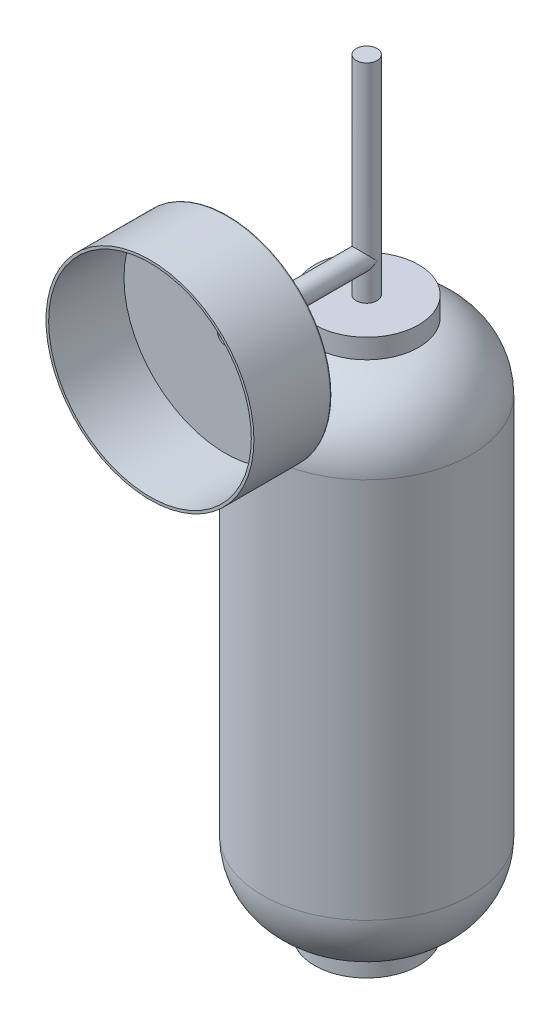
ISO-10303-21;
HEADER;
FILE_DESCRIPTION(('STEP AP214'),'2;1');
FILE_NAME('part.step','',(''),(''),'','','');
FILE_SCHEMA(('AUTOMOTIVE_DESIGN { 1 0 10303 214 1 1 1 1 }'));
ENDSEC;
DATA;
#1=APPLICATION_CONTEXT('core data for automotive mechanical design processes');
#2=APPLICATION_PROTOCOL_DEFINITION('international standard','automotive_design',2000,#1);
#3=PRODUCT_CONTEXT('',#1,'mechanical');
#4=PRODUCT('Part','Part','',(#3));
#5=PRODUCT_RELATED_PRODUCT_CATEGORY('part','',(#4));
#6=PRODUCT_DEFINITION_FORMATION('','',#4);
#7=PRODUCT_DEFINITION_CONTEXT('part definition',#1,'design');
#8=PRODUCT_DEFINITION('design','',#6,#7);
#9=PRODUCT_DEFINITION_SHAPE('','',#8);
#10=(LENGTH_UNIT() NAMED_UNIT(*) SI_UNIT(.MILLI.,.METRE.));
#11=(NAMED_UNIT(*) PLANE_ANGLE_UNIT() SI_UNIT($,.RADIAN.));
#12=(NAMED_UNIT(*) SI_UNIT($,.STERADIAN.) SOLID_ANGLE_UNIT());
#13=UNCERTAINTY_MEASURE_WITH_UNIT(LENGTH_MEASURE(1.E-05),#10,'distance_accuracy_value','');
#14=(GEOMETRIC_REPRESENTATION_CONTEXT(3) GLOBAL_UNCERTAINTY_ASSIGNED_CONTEXT((#13)) GLOBAL_UNIT_ASSIGNED_CONTEXT((#10,
#11,#12)) REPRESENTATION_CONTEXT('',''));
#15=CARTESIAN_POINT('',(0.,0.,0.));
#16=DIRECTION('',(0.,0.,1.));
#17=DIRECTION('',(1.,0.,0.));
#18=AXIS2_PLACEMENT_3D('',#15,#16,#17);
#19=CARTESIAN_POINT('',(0.,5.,0.));
#20=DIRECTION('',(0.,1.,0.));
#21=DIRECTION('',(0.,0.,1.));
#22=AXIS2_PLACEMENT_3D('',#19,#20,#21);
#23=CYLINDRICAL_SURFACE('',#22,30.);
#24=CARTESIAN_POINT('',(0.,5.,0.));
#25=DIRECTION('',(0.,1.,0.));
#26=DIRECTION('',(0.,0.,1.));
#27=AXIS2_PLACEMENT_3D('',#24,#25,#26);
#28=CIRCLE('',#27,30.);
#29=CARTESIAN_POINT('',(0.,5.,30.));
#30=VERTEX_POINT('',#29);
#31=EDGE_CURVE('E12',#30,#30,#28,.T.);
#32=ORIENTED_EDGE('',*,*,#31,.T.);
#33=EDGE_LOOP('',(#32));
#34=FACE_BOUND('',#33,.T.);
#35=CARTESIAN_POINT('',(0.,295.,0.));
#36=DIRECTION('',(0.,1.,0.));
#37=DIRECTION('',(0.,0.,1.));
#38=AXIS2_PLACEMENT_3D('',#35,#36,#37);
#39=CIRCLE('',#38,30.);
#40=CARTESIAN_POINT('',(0.,295.,30.));
#41=VERTEX_POINT('',#40);
#42=EDGE_CURVE('E61',#41,#41,#39,.T.);
#43=ORIENTED_EDGE('',*,*,#42,.F.);
#44=EDGE_LOOP('',(#43));
#45=FACE_BOUND('',#44,.T.);
#46=ADVANCED_FACE('F55',(#34,#45),#23,.T.);
#47=CARTESIAN_POINT('',(0.,5.,0.));
#48=DIRECTION('',(0.,1.,0.));
#49=DIRECTION('',(0.,0.,1.));
#50=AXIS2_PLACEMENT_3D('',#47,#48,#49);
#51=PLANE('',#50);
#52=ORIENTED_EDGE('',*,*,#31,.F.);
#53=EDGE_LOOP('',(#52));
#54=FACE_BOUND('',#53,.T.);
#55=ADVANCED_FACE('F70',(#54),#51,.F.);
#56=CARTESIAN_POINT('',(0.,295.,0.));
#57=DIRECTION('',(0.,1.,0.));
#58=DIRECTION('',(0.,0.,1.));
#59=AXIS2_PLACEMENT_3D('',#56,#57,#58);
#60=PLANE('',#59);
#61=ORIENTED_EDGE('',*,*,#42,.T.);
#62=EDGE_LOOP('',(#61));
#63=FACE_BOUND('',#62,.T.);
#64=ADVANCED_FACE('F67',(#63),#60,.T.);
#65=CLOSED_SHELL('',(#46,#55,#64));
#66=MANIFOLD_SOLID_BREP('B2',#65);
#67=CARTESIAN_POINT('',(0.,-10.,0.));
#68=DIRECTION('',(0.,1.,0.));
#69=DIRECTION('',(0.,0.,-1.));
#70=AXIS2_PLACEMENT_3D('',#67,#68,#69);
#71=CYLINDRICAL_SURFACE('',#70,30.);
#72=CARTESIAN_POINT('',(0.,-10.,0.));
#73=DIRECTION('',(0.,1.,0.));
#74=DIRECTION('',(0.,0.,1.));
#75=AXIS2_PLACEMENT_3D('',#72,#73,#74);
#76=CIRCLE('',#75,30.);
#77=CARTESIAN_POINT('',(0.,-10.,30.));
#78=VERTEX_POINT('',#77);
#79=EDGE_CURVE('E111',#78,#78,#76,.T.);
#80=ORIENTED_EDGE('',*,*,#79,.T.);
#81=EDGE_LOOP('',(#80));
#82=FACE_BOUND('',#81,.T.);
#83=CARTESIAN_POINT('',(0.,1.27016653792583,0.));
#84=DIRECTION('',(0.,-1.,0.));
#85=DIRECTION('',(0.,0.,-1.));
#86=AXIS2_PLACEMENT_3D('',#83,#84,#85);
#87=CIRCLE('',#86,30.);
#88=CARTESIAN_POINT('',(0.,1.27016653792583,-30.));
#89=VERTEX_POINT('',#88);
#90=EDGE_CURVE('E115',#89,#89,#87,.F.);
#91=ORIENTED_EDGE('',*,*,#90,.F.);
#92=EDGE_LOOP('',(#91));
#93=FACE_BOUND('',#92,.T.);
#94=ADVANCED_FACE('F105',(#82,#93),#71,.T.);
#95=CARTESIAN_POINT('',(0.,-10.,0.));
#96=DIRECTION('',(0.,-1.,0.));
#97=DIRECTION('',(0.,0.,1.));
#98=AXIS2_PLACEMENT_3D('',#95,#96,#97);
#99=PLANE('',#98);
#100=ORIENTED_EDGE('',*,*,#79,.F.);
#101=EDGE_LOOP('',(#100));
#102=FACE_BOUND('',#101,.T.);
#103=ADVANCED_FACE('F126',(#102),#99,.T.);
#104=CARTESIAN_POINT('',(0.,40.,0.));
#105=DIRECTION('',(0.,1.,0.));
#106=DIRECTION('',(0.,0.,-1.));
#107=AXIS2_PLACEMENT_3D('',#104,#105,#106);
#108=DEGENERATE_TOROIDAL_SURFACE('',#107,20.,40.,.T.);
#109=ORIENTED_EDGE('',*,*,#90,.T.);
#110=EDGE_LOOP('',(#109));
#111=FACE_BOUND('',#110,.T.);
#112=CARTESIAN_POINT('',(0.,0.,0.));
#113=DIRECTION('',(0.,-1.,0.));
#114=DIRECTION('',(0.,0.,-1.));
#115=AXIS2_PLACEMENT_3D('',#112,#113,#114);
#116=CIRCLE('',#115,20.);
#117=CARTESIAN_POINT('',(0.,0.,-20.));
#118=VERTEX_POINT('',#117);
#119=EDGE_CURVE('E54',#118,#118,#116,.F.);
#120=ORIENTED_EDGE('',*,*,#119,.F.);
#121=EDGE_LOOP('',(#120));
#122=FACE_BOUND('',#121,.T.);
#123=ADVANCED_FACE('F122',(#111,#122),#108,.F.);
#124=CARTESIAN_POINT('',(0.,0.,0.));
#125=DIRECTION('',(0.,-1.,0.));
#126=DIRECTION('',(0.,0.,1.));
#127=AXIS2_PLACEMENT_3D('',#124,#125,#126);
#128=PLANE('',#127);
#129=ORIENTED_EDGE('',*,*,#119,.T.);
#130=EDGE_LOOP('',(#129));
#131=FACE_BOUND('',#130,.T.);
#132=ADVANCED_FACE('F135',(#131),#128,.F.);
#133=CLOSED_SHELL('',(#94,#103,#123,#132));
#134=MANIFOLD_SOLID_BREP('B7',#133);
#135=CARTESIAN_POINT('',(0.,310.,0.));
#136=DIRECTION('',(0.,-1.,0.));
#137=DIRECTION('',(0.,0.,-1.));
#138=AXIS2_PLACEMENT_3D('',#135,#136,#137);
#139=CYLINDRICAL_SURFACE('',#138,30.);
#140=CARTESIAN_POINT('',(0.,310.,0.));
#141=DIRECTION('',(0.,1.,0.));
#142=DIRECTION('',(0.,0.,1.));
#143=AXIS2_PLACEMENT_3D('',#140,#141,#142);
#144=CIRCLE('',#143,30.);
#145=CARTESIAN_POINT('',(0.,310.,30.));
#146=VERTEX_POINT('',#145);
#147=EDGE_CURVE('E237',#146,#146,#144,.T.);
#148=ORIENTED_EDGE('',*,*,#147,.F.);
#149=EDGE_LOOP('',(#148));
#150=FACE_BOUND('',#149,.T.);
#151=CARTESIAN_POINT('',(0.,298.729833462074,0.));
#152=DIRECTION('',(0.,-1.,0.));
#153=DIRECTION('',(0.,0.,-1.));
#154=AXIS2_PLACEMENT_3D('',#151,#152,#153);
#155=CIRCLE('',#154,30.);
#156=CARTESIAN_POINT('',(0.,298.729833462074,-30.));
#157=VERTEX_POINT('',#156);
#158=EDGE_CURVE('E230',#157,#157,#155,.F.);
#159=ORIENTED_EDGE('',*,*,#158,.T.);
#160=EDGE_LOOP('',(#159));
#161=FACE_BOUND('',#160,.T.);
#162=ADVANCED_FACE('F167',(#150,#161),#139,.T.);
#163=CARTESIAN_POINT('',(0.,310.,0.));
#164=DIRECTION('',(0.,1.,0.));
#165=DIRECTION('',(0.,0.,1.));
#166=AXIS2_PLACEMENT_3D('',#163,#164,#165);
#167=PLANE('',#166);
#168=CARTESIAN_POINT('',(0.,310.,0.));
#169=DIRECTION('',(0.,1.,0.));
#170=DIRECTION('',(0.,0.,1.));
#171=AXIS2_PLACEMENT_3D('',#168,#169,#170);
#172=CIRCLE('',#171,6.);
#173=CARTESIAN_POINT('',(0.,310.,6.));
#174=VERTEX_POINT('',#173);
#175=EDGE_CURVE('E231',#174,#174,#172,.T.);
#176=ORIENTED_EDGE('',*,*,#175,.F.);
#177=EDGE_LOOP('',(#176));
#178=FACE_BOUND('',#177,.T.);
#179=ORIENTED_EDGE('',*,*,#147,.T.);
#180=EDGE_LOOP('',(#179));
#181=FACE_BOUND('',#180,.T.);
#182=ADVANCED_FACE('F265',(#178,#181),#167,.T.);
#183=CARTESIAN_POINT('',(0.,260.,0.));
#184=DIRECTION('',(0.,-1.,0.));
#185=DIRECTION('',(0.,0.,-1.));
#186=AXIS2_PLACEMENT_3D('',#183,#184,#185);
#187=DEGENERATE_TOROIDAL_SURFACE('',#186,20.,40.,.T.);
#188=ORIENTED_EDGE('',*,*,#158,.F.);
#189=EDGE_LOOP('',(#188));
#190=FACE_BOUND('',#189,.T.);
#191=CARTESIAN_POINT('',(0.,300.,0.));
#192=DIRECTION('',(0.,-1.,0.));
#193=DIRECTION('',(0.,0.,-1.));
#194=AXIS2_PLACEMENT_3D('',#191,#192,#193);
#195=CIRCLE('',#194,20.);
#196=CARTESIAN_POINT('',(0.,300.,-20.));
#197=VERTEX_POINT('',#196);
#198=EDGE_CURVE('E234',#197,#197,#195,.F.);
#199=ORIENTED_EDGE('',*,*,#198,.T.);
#200=EDGE_LOOP('',(#199));
#201=FACE_BOUND('',#200,.T.);
#202=ADVANCED_FACE('F270',(#190,#201),#187,.F.);
#203=CARTESIAN_POINT('',(0.,300.,0.));
#204=DIRECTION('',(0.,1.,0.));
#205=DIRECTION('',(0.,0.,1.));
#206=AXIS2_PLACEMENT_3D('',#203,#204,#205);
#207=PLANE('',#206);
#208=ORIENTED_EDGE('',*,*,#198,.F.);
#209=EDGE_LOOP('',(#208));
#210=FACE_BOUND('',#209,.T.);
#211=ADVANCED_FACE('F276',(#210),#207,.F.);
#212=CARTESIAN_POINT('',(0.,430.,0.));
#213=DIRECTION('',(0.,-1.,0.));
#214=DIRECTION('',(0.,0.,-1.));
#215=AXIS2_PLACEMENT_3D('',#212,#213,#214);
#216=CYLINDRICAL_SURFACE('',#215,6.);
#217=CARTESIAN_POINT('',(0.,330.,0.));
#218=DIRECTION('',(0.,-0.707106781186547,-0.707106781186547));
#219=DIRECTION('',(0.,-0.707106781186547,0.707106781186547));
#220=AXIS2_PLACEMENT_3D('',#217,#218,#219);
#221=ELLIPSE('',#220,8.48528137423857,6.);
#222=CARTESIAN_POINT('',(6.,330.,0.));
#223=VERTEX_POINT('',#222);
#224=CARTESIAN_POINT('',(-6.,330.,0.));
#225=VERTEX_POINT('',#224);
#226=EDGE_CURVE('E184',#223,#225,#221,.T.);
#227=ORIENTED_EDGE('',*,*,#226,.T.);
#228=CARTESIAN_POINT('',(0.,330.,0.));
#229=DIRECTION('',(0.,-0.707106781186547,0.707106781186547));
#230=DIRECTION('',(0.,-0.707106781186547,-0.707106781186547));
#231=AXIS2_PLACEMENT_3D('',#228,#229,#230);
#232=ELLIPSE('',#231,8.48528137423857,6.);
#233=EDGE_CURVE('E181',#225,#223,#232,.F.);
#234=ORIENTED_EDGE('',*,*,#233,.T.);
#235=EDGE_LOOP('',(#227,#234));
#236=FACE_BOUND('',#235,.T.);
#237=CARTESIAN_POINT('',(0.,430.,0.));
#238=DIRECTION('',(0.,1.,0.));
#239=DIRECTION('',(0.,0.,1.));
#240=AXIS2_PLACEMENT_3D('',#237,#238,#239);
#241=CIRCLE('',#240,6.);
#242=CARTESIAN_POINT('',(0.,430.,6.));
#243=VERTEX_POINT('',#242);
#244=EDGE_CURVE('E227',#243,#243,#241,.T.);
#245=ORIENTED_EDGE('',*,*,#244,.F.);
#246=EDGE_LOOP('',(#245));
#247=FACE_BOUND('',#246,.T.);
#248=ORIENTED_EDGE('',*,*,#175,.T.);
#249=EDGE_LOOP('',(#248));
#250=FACE_BOUND('',#249,.T.);
#251=ADVANCED_FACE('F278',(#236,#247,#250),#216,.T.);
#252=CARTESIAN_POINT('',(0.,430.,0.));
#253=DIRECTION('',(0.,1.,0.));
#254=DIRECTION('',(0.,0.,1.));
#255=AXIS2_PLACEMENT_3D('',#252,#253,#254);
#256=PLANE('',#255);
#257=ORIENTED_EDGE('',*,*,#244,.T.);
#258=EDGE_LOOP('',(#257));
#259=FACE_BOUND('',#258,.T.);
#260=ADVANCED_FACE('F286',(#259),#256,.T.);
#261=CARTESIAN_POINT('',(0.,330.,0.));
#262=DIRECTION('',(0.,0.,1.));
#263=DIRECTION('',(1.,0.,0.));
#264=AXIS2_PLACEMENT_3D('',#261,#262,#263);
#265=CYLINDRICAL_SURFACE('',#264,6.);
#266=CARTESIAN_POINT('',(0.,330.,80.));
#267=DIRECTION('',(0.,0.,1.));
#268=DIRECTION('',(1.,0.,0.));
#269=AXIS2_PLACEMENT_3D('',#266,#267,#268);
#270=CIRCLE('',#269,6.);
#271=CARTESIAN_POINT('',(6.,330.,80.));
#272=VERTEX_POINT('',#271);
#273=EDGE_CURVE('E224',#272,#272,#270,.T.);
#274=ORIENTED_EDGE('',*,*,#273,.F.);
#275=EDGE_LOOP('',(#274));
#276=FACE_BOUND('',#275,.T.);
#277=ORIENTED_EDGE('',*,*,#233,.F.);
#278=ORIENTED_EDGE('',*,*,#226,.F.);
#279=EDGE_LOOP('',(#277,#278));
#280=FACE_BOUND('',#279,.T.);
#281=ADVANCED_FACE('F290',(#276,#280),#265,.T.);
#282=CARTESIAN_POINT('',(0.,330.,124.958));
#283=DIRECTION('',(0.,0.,-1.));
#284=DIRECTION('',(-1.,0.,0.));
#285=AXIS2_PLACEMENT_3D('',#282,#283,#284);
#286=CYLINDRICAL_SURFACE('',#285,59.944);
#287=CARTESIAN_POINT('',(0.,330.,81.));
#288=DIRECTION('',(0.,0.,1.));
#289=DIRECTION('',(1.,0.,0.));
#290=AXIS2_PLACEMENT_3D('',#287,#288,#289);
#291=CIRCLE('',#290,59.944);
#292=CARTESIAN_POINT('',(59.944,330.,81.));
#293=VERTEX_POINT('',#292);
#294=EDGE_CURVE('E175',#293,#293,#291,.T.);
#295=ORIENTED_EDGE('',*,*,#294,.T.);
#296=EDGE_LOOP('',(#295));
#297=FACE_BOUND('',#296,.T.);
#298=CARTESIAN_POINT('',(0.,330.,124.958));
#299=DIRECTION('',(0.,0.,1.));
#300=DIRECTION('',(1.,0.,0.));
#301=AXIS2_PLACEMENT_3D('',#298,#299,#300);
#302=CIRCLE('',#301,59.944);
#303=CARTESIAN_POINT('',(59.944,330.,124.958));
#304=VERTEX_POINT('',#303);
#305=EDGE_CURVE('E204',#304,#304,#302,.T.);
#306=ORIENTED_EDGE('',*,*,#305,.F.);
#307=EDGE_LOOP('',(#306));
#308=FACE_BOUND('',#307,.T.);
#309=ADVANCED_FACE('F246',(#297,#308),#286,.T.);
#310=CARTESIAN_POINT('',(0.,330.,124.958));
#311=DIRECTION('',(0.,0.,1.));
#312=DIRECTION('',(1.,0.,0.));
#313=AXIS2_PLACEMENT_3D('',#310,#311,#312);
#314=PLANE('',#313);
#315=CARTESIAN_POINT('',(0.,330.,124.958));
#316=DIRECTION('',(0.,0.,1.));
#317=DIRECTION('',(1.,0.,0.));
#318=AXIS2_PLACEMENT_3D('',#315,#316,#317);
#319=CIRCLE('',#318,58.444);
#320=CARTESIAN_POINT('',(58.444,330.,124.958));
#321=VERTEX_POINT('',#320);
#322=EDGE_CURVE('E214',#321,#321,#319,.T.);
#323=ORIENTED_EDGE('',*,*,#322,.F.);
#324=EDGE_LOOP('',(#323));
#325=FACE_BOUND('',#324,.T.);
#326=ORIENTED_EDGE('',*,*,#305,.T.);
#327=EDGE_LOOP('',(#326));
#328=FACE_BOUND('',#327,.T.);
#329=ADVANCED_FACE('F260',(#325,#328),#314,.T.);
#330=CARTESIAN_POINT('',(0.,330.,80.));
#331=DIRECTION('',(0.,0.,1.));
#332=DIRECTION('',(1.,0.,0.));
#333=AXIS2_PLACEMENT_3D('',#330,#331,#332);
#334=PLANE('',#333);
#335=CARTESIAN_POINT('',(0.,330.,80.));
#336=DIRECTION('',(0.,0.,1.));
#337=DIRECTION('',(1.,0.,0.));
#338=AXIS2_PLACEMENT_3D('',#335,#336,#337);
#339=CIRCLE('',#338,58.944);
#340=CARTESIAN_POINT('',(58.944,330.,80.));
#341=VERTEX_POINT('',#340);
#342=EDGE_CURVE('E103',#341,#341,#339,.F.);
#343=ORIENTED_EDGE('',*,*,#342,.T.);
#344=EDGE_LOOP('',(#343));
#345=FACE_BOUND('',#344,.T.);
#346=ORIENTED_EDGE('',*,*,#273,.T.);
#347=EDGE_LOOP('',(#346));
#348=FACE_BOUND('',#347,.T.);
#349=ADVANCED_FACE('F251',(#345,#348),#334,.F.);
#350=CARTESIAN_POINT('',(0.,330.,81.));
#351=DIRECTION('',(0.,0.,1.));
#352=DIRECTION('',(1.,0.,0.));
#353=AXIS2_PLACEMENT_3D('',#350,#351,#352);
#354=TOROIDAL_SURFACE('',#353,58.944,1.);
#355=ORIENTED_EDGE('',*,*,#342,.F.);
#356=EDGE_LOOP('',(#355));
#357=FACE_BOUND('',#356,.T.);
#358=ORIENTED_EDGE('',*,*,#294,.F.);
#359=EDGE_LOOP('',(#358));
#360=FACE_BOUND('',#359,.T.);
#361=ADVANCED_FACE('F169',(#357,#360),#354,.T.);
#362=CARTESIAN_POINT('',(0.,310.,0.));
#363=DIRECTION('',(0.,-1.,0.));
#364=DIRECTION('',(0.,0.,-1.));
#365=AXIS2_PLACEMENT_3D('',#362,#363,#364);
#366=CYLINDRICAL_SURFACE('',#365,28.5);
#367=CARTESIAN_POINT('',(0.,308.5,0.));
#368=DIRECTION('',(0.,1.,0.));
#369=DIRECTION('',(0.,0.,1.));
#370=AXIS2_PLACEMENT_3D('',#367,#368,#369);
#371=CIRCLE('',#370,28.5);
#372=CARTESIAN_POINT('',(0.,308.5,28.5));
#373=VERTEX_POINT('',#372);
#374=EDGE_CURVE('E219',#373,#373,#371,.T.);
#375=ORIENTED_EDGE('',*,*,#374,.T.);
#376=EDGE_LOOP('',(#375));
#377=FACE_BOUND('',#376,.T.);
#378=CARTESIAN_POINT('',(0.,300.62019202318,0.));
#379=DIRECTION('',(0.,-1.,0.));
#380=DIRECTION('',(0.,0.,-1.));
#381=AXIS2_PLACEMENT_3D('',#378,#379,#380);
#382=CIRCLE('',#381,28.5);
#383=CARTESIAN_POINT('',(0.,300.62019202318,-28.5));
#384=VERTEX_POINT('',#383);
#385=EDGE_CURVE('E211',#384,#384,#382,.F.);
#386=ORIENTED_EDGE('',*,*,#385,.F.);
#387=EDGE_LOOP('',(#386));
#388=FACE_BOUND('',#387,.T.);
#389=ADVANCED_FACE('F250',(#377,#388),#366,.F.);
#390=CARTESIAN_POINT('',(0.,308.5,0.));
#391=DIRECTION('',(0.,1.,0.));
#392=DIRECTION('',(0.,0.,1.));
#393=AXIS2_PLACEMENT_3D('',#390,#391,#392);
#394=PLANE('',#393);
#395=CARTESIAN_POINT('',(0.,308.5,0.));
#396=DIRECTION('',(0.,1.,0.));
#397=DIRECTION('',(0.,0.,1.));
#398=AXIS2_PLACEMENT_3D('',#395,#396,#397);
#399=CIRCLE('',#398,4.5);
#400=CARTESIAN_POINT('',(0.,308.5,4.5));
#401=VERTEX_POINT('',#400);
#402=EDGE_CURVE('E198',#401,#401,#399,.T.);
#403=ORIENTED_EDGE('',*,*,#402,.T.);
#404=EDGE_LOOP('',(#403));
#405=FACE_BOUND('',#404,.T.);
#406=ORIENTED_EDGE('',*,*,#374,.F.);
#407=EDGE_LOOP('',(#406));
#408=FACE_BOUND('',#407,.T.);
#409=ADVANCED_FACE('F257',(#405,#408),#394,.F.);
#410=CARTESIAN_POINT('',(0.,260.,0.));
#411=DIRECTION('',(0.,-1.,0.));
#412=DIRECTION('',(0.,0.,-1.));
#413=AXIS2_PLACEMENT_3D('',#410,#411,#412);
#414=DEGENERATE_TOROIDAL_SURFACE('',#413,20.,41.5,.T.);
#415=ORIENTED_EDGE('',*,*,#385,.T.);
#416=EDGE_LOOP('',(#415));
#417=FACE_BOUND('',#416,.T.);
#418=CARTESIAN_POINT('',(0.,301.5,0.));
#419=DIRECTION('',(0.,-1.,0.));
#420=DIRECTION('',(0.,0.,-1.));
#421=AXIS2_PLACEMENT_3D('',#418,#419,#420);
#422=CIRCLE('',#421,20.);
#423=CARTESIAN_POINT('',(0.,301.5,-20.));
#424=VERTEX_POINT('',#423);
#425=EDGE_CURVE('E216',#424,#424,#422,.F.);
#426=ORIENTED_EDGE('',*,*,#425,.F.);
#427=EDGE_LOOP('',(#426));
#428=FACE_BOUND('',#427,.T.);
#429=ADVANCED_FACE('F320',(#417,#428),#414,.T.);
#430=CARTESIAN_POINT('',(0.,301.5,0.));
#431=DIRECTION('',(0.,1.,0.));
#432=DIRECTION('',(0.,0.,1.));
#433=AXIS2_PLACEMENT_3D('',#430,#431,#432);
#434=PLANE('',#433);
#435=ORIENTED_EDGE('',*,*,#425,.T.);
#436=EDGE_LOOP('',(#435));
#437=FACE_BOUND('',#436,.T.);
#438=ADVANCED_FACE('F317',(#437),#434,.T.);
#439=CARTESIAN_POINT('',(0.,430.,0.));
#440=DIRECTION('',(0.,-1.,0.));
#441=DIRECTION('',(0.,0.,-1.));
#442=AXIS2_PLACEMENT_3D('',#439,#440,#441);
#443=CYLINDRICAL_SURFACE('',#442,4.5);
#444=CARTESIAN_POINT('',(0.,330.,0.));
#445=DIRECTION('',(0.,-0.707106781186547,-0.707106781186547));
#446=DIRECTION('',(0.,-0.707106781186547,0.707106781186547));
#447=AXIS2_PLACEMENT_3D('',#444,#445,#446);
#448=ELLIPSE('',#447,6.36396103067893,4.5);
#449=CARTESIAN_POINT('',(4.5,330.,0.));
#450=VERTEX_POINT('',#449);
#451=CARTESIAN_POINT('',(-4.5,330.,0.));
#452=VERTEX_POINT('',#451);
#453=EDGE_CURVE('E192',#450,#452,#448,.T.);
#454=ORIENTED_EDGE('',*,*,#453,.F.);
#455=CARTESIAN_POINT('',(0.,330.,0.));
#456=DIRECTION('',(0.,-0.707106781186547,0.707106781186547));
#457=DIRECTION('',(0.,-0.707106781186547,-0.707106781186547));
#458=AXIS2_PLACEMENT_3D('',#455,#456,#457);
#459=ELLIPSE('',#458,6.36396103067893,4.5);
#460=EDGE_CURVE('E196',#452,#450,#459,.F.);
#461=ORIENTED_EDGE('',*,*,#460,.F.);
#462=EDGE_LOOP('',(#454,#461));
#463=FACE_BOUND('',#462,.T.);
#464=CARTESIAN_POINT('',(0.,428.5,0.));
#465=DIRECTION('',(0.,1.,0.));
#466=DIRECTION('',(0.,0.,1.));
#467=AXIS2_PLACEMENT_3D('',#464,#465,#466);
#468=CIRCLE('',#467,4.5);
#469=CARTESIAN_POINT('',(0.,428.5,4.5));
#470=VERTEX_POINT('',#469);
#471=EDGE_CURVE('E208',#470,#470,#468,.T.);
#472=ORIENTED_EDGE('',*,*,#471,.T.);
#473=EDGE_LOOP('',(#472));
#474=FACE_BOUND('',#473,.T.);
#475=ORIENTED_EDGE('',*,*,#402,.F.);
#476=EDGE_LOOP('',(#475));
#477=FACE_BOUND('',#476,.T.);
#478=ADVANCED_FACE('F194',(#463,#474,#477),#443,.F.);
#479=CARTESIAN_POINT('',(0.,428.5,0.));
#480=DIRECTION('',(0.,1.,0.));
#481=DIRECTION('',(0.,0.,1.));
#482=AXIS2_PLACEMENT_3D('',#479,#480,#481);
#483=PLANE('',#482);
#484=ORIENTED_EDGE('',*,*,#471,.F.);
#485=EDGE_LOOP('',(#484));
#486=FACE_BOUND('',#485,.T.);
#487=ADVANCED_FACE('F310',(#486),#483,.F.);
#488=CARTESIAN_POINT('',(0.,330.,0.));
#489=DIRECTION('',(0.,0.,1.));
#490=DIRECTION('',(1.,0.,0.));
#491=AXIS2_PLACEMENT_3D('',#488,#489,#490);
#492=CYLINDRICAL_SURFACE('',#491,4.5);
#493=CARTESIAN_POINT('',(0.,330.,81.5));
#494=DIRECTION('',(0.,0.,1.));
#495=DIRECTION('',(1.,0.,0.));
#496=AXIS2_PLACEMENT_3D('',#493,#494,#495);
#497=CIRCLE('',#496,4.5);
#498=CARTESIAN_POINT('',(4.5,330.,81.5));
#499=VERTEX_POINT('',#498);
#500=EDGE_CURVE('E212',#499,#499,#497,.T.);
#501=ORIENTED_EDGE('',*,*,#500,.T.);
#502=EDGE_LOOP('',(#501));
#503=FACE_BOUND('',#502,.T.);
#504=ORIENTED_EDGE('',*,*,#460,.T.);
#505=ORIENTED_EDGE('',*,*,#453,.T.);
#506=EDGE_LOOP('',(#504,#505));
#507=FACE_BOUND('',#506,.T.);
#508=ADVANCED_FACE('F200',(#503,#507),#492,.F.);
#509=CARTESIAN_POINT('',(0.,330.,124.958));
#510=DIRECTION('',(0.,0.,-1.));
#511=DIRECTION('',(-1.,0.,0.));
#512=AXIS2_PLACEMENT_3D('',#509,#510,#511);
#513=CYLINDRICAL_SURFACE('',#512,58.444);
#514=CARTESIAN_POINT('',(0.,330.,81.5));
#515=DIRECTION('',(0.,0.,1.));
#516=DIRECTION('',(1.,0.,0.));
#517=AXIS2_PLACEMENT_3D('',#514,#515,#516);
#518=CIRCLE('',#517,58.444);
#519=CARTESIAN_POINT('',(58.444,330.,81.5));
#520=VERTEX_POINT('',#519);
#521=EDGE_CURVE('E201',#520,#520,#518,.T.);
#522=ORIENTED_EDGE('',*,*,#521,.F.);
#523=EDGE_LOOP('',(#522));
#524=FACE_BOUND('',#523,.T.);
#525=ORIENTED_EDGE('',*,*,#322,.T.);
#526=EDGE_LOOP('',(#525));
#527=FACE_BOUND('',#526,.T.);
#528=ADVANCED_FACE('F303',(#524,#527),#513,.F.);
#529=CARTESIAN_POINT('',(0.,330.,81.5));
#530=DIRECTION('',(0.,0.,1.));
#531=DIRECTION('',(1.,0.,0.));
#532=AXIS2_PLACEMENT_3D('',#529,#530,#531);
#533=PLANE('',#532);
#534=ORIENTED_EDGE('',*,*,#521,.T.);
#535=EDGE_LOOP('',(#534));
#536=FACE_BOUND('',#535,.T.);
#537=ORIENTED_EDGE('',*,*,#500,.F.);
#538=EDGE_LOOP('',(#537));
#539=FACE_BOUND('',#538,.T.);
#540=ADVANCED_FACE('F300',(#536,#539),#533,.T.);
#541=CLOSED_SHELL('',(#162,#182,#202,#211,#251,#260,#281,#309,#329,#349,#361,#389,#409,#429,
#438,#478,#487,#508,#528,#540));
#542=MANIFOLD_SOLID_BREP('B49',#541);
#543=CARTESIAN_POINT('',(-20.,300.,0.));
#544=DIRECTION('',(0.,-1.,0.));
#545=DIRECTION('',(0.,0.,-1.));
#546=AXIS2_PLACEMENT_3D('',#543,#544,#545);
#547=PLANE('',#546);
#548=CARTESIAN_POINT('',(0.,300.,0.));
#549=DIRECTION('',(0.,-1.,0.));
#550=DIRECTION('',(0.,0.,-1.));
#551=AXIS2_PLACEMENT_3D('',#548,#549,#550);
#552=CIRCLE('',#551,20.);
#553=CARTESIAN_POINT('',(0.,300.,-20.));
#554=VERTEX_POINT('',#553);
#555=EDGE_CURVE('E166',#554,#554,#552,.T.);
#556=ORIENTED_EDGE('',*,*,#555,.F.);
#557=EDGE_LOOP('',(#556));
#558=FACE_BOUND('',#557,.T.);
#559=ADVANCED_FACE('F502',(#558),#547,.F.);
#560=CARTESIAN_POINT('',(0.,260.,0.));
#561=DIRECTION('',(0.,-1.,0.));
#562=DIRECTION('',(0.,0.,-1.));
#563=AXIS2_PLACEMENT_3D('',#560,#561,#562);
#564=DEGENERATE_TOROIDAL_SURFACE('',#563,20.,40.,.T.);
#565=CARTESIAN_POINT('',(0.,260.,0.));
#566=DIRECTION('',(0.,-1.,0.));
#567=DIRECTION('',(0.,0.,-1.));
#568=AXIS2_PLACEMENT_3D('',#565,#566,#567);
#569=CIRCLE('',#568,60.);
#570=CARTESIAN_POINT('',(0.,260.,-60.));
#571=VERTEX_POINT('',#570);
#572=EDGE_CURVE('E509',#571,#571,#569,.T.);
#573=ORIENTED_EDGE('',*,*,#572,.F.);
#574=EDGE_LOOP('',(#573));
#575=FACE_BOUND('',#574,.T.);
#576=ORIENTED_EDGE('',*,*,#555,.T.);
#577=EDGE_LOOP('',(#576));
#578=FACE_BOUND('',#577,.T.);
#579=ADVANCED_FACE('F553',(#575,#578),#564,.T.);
#580=CARTESIAN_POINT('',(0.,0.,0.));
#581=DIRECTION('',(0.,-1.,0.));
#582=DIRECTION('',(0.,0.,-1.));
#583=AXIS2_PLACEMENT_3D('',#580,#581,#582);
#584=CYLINDRICAL_SURFACE('',#583,60.);
#585=CARTESIAN_POINT('',(0.,40.,0.));
#586=DIRECTION('',(0.,-1.,0.));
#587=DIRECTION('',(0.,0.,-1.));
#588=AXIS2_PLACEMENT_3D('',#585,#586,#587);
#589=CIRCLE('',#588,60.);
#590=CARTESIAN_POINT('',(0.,40.,-60.));
#591=VERTEX_POINT('',#590);
#592=EDGE_CURVE('E514',#591,#591,#589,.T.);
#593=ORIENTED_EDGE('',*,*,#592,.F.);
#594=EDGE_LOOP('',(#593));
#595=FACE_BOUND('',#594,.T.);
#596=ORIENTED_EDGE('',*,*,#572,.T.);
#597=EDGE_LOOP('',(#596));
#598=FACE_BOUND('',#597,.T.);
#599=ADVANCED_FACE('F548',(#595,#598),#584,.T.);
#600=CARTESIAN_POINT('',(0.,40.,0.));
#601=DIRECTION('',(0.,-1.,0.));
#602=DIRECTION('',(0.,0.,-1.));
#603=AXIS2_PLACEMENT_3D('',#600,#601,#602);
#604=DEGENERATE_TOROIDAL_SURFACE('',#603,20.,40.,.T.);
#605=CARTESIAN_POINT('',(0.,0.,0.));
#606=DIRECTION('',(0.,-1.,0.));
#607=DIRECTION('',(0.,0.,-1.));
#608=AXIS2_PLACEMENT_3D('',#605,#606,#607);
#609=CIRCLE('',#608,20.);
#610=CARTESIAN_POINT('',(0.,0.,-20.));
#611=VERTEX_POINT('',#610);
#612=EDGE_CURVE('E531',#611,#611,#609,.T.);
#613=ORIENTED_EDGE('',*,*,#612,.F.);
#614=EDGE_LOOP('',(#613));
#615=FACE_BOUND('',#614,.T.);
#616=ORIENTED_EDGE('',*,*,#592,.T.);
#617=EDGE_LOOP('',(#616));
#618=FACE_BOUND('',#617,.T.);
#619=ADVANCED_FACE('F545',(#615,#618),#604,.T.);
#620=CARTESIAN_POINT('',(0.,0.,0.));
#621=DIRECTION('',(0.,1.,0.));
#622=DIRECTION('',(0.,0.,1.));
#623=AXIS2_PLACEMENT_3D('',#620,#621,#622);
#624=CYLINDRICAL_SURFACE('',#623,20.);
#625=ORIENTED_EDGE('',*,*,#612,.T.);
#626=EDGE_LOOP('',(#625));
#627=FACE_BOUND('',#626,.T.);
#628=CARTESIAN_POINT('',(0.,8.00000000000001,0.));
#629=DIRECTION('',(0.,1.,0.));
#630=DIRECTION('',(0.,0.,1.));
#631=AXIS2_PLACEMENT_3D('',#628,#629,#630);
#632=CIRCLE('',#631,20.);
#633=CARTESIAN_POINT('',(0.,8.00000000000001,20.));
#634=VERTEX_POINT('',#633);
#635=EDGE_CURVE('E519',#634,#634,#632,.F.);
#636=ORIENTED_EDGE('',*,*,#635,.F.);
#637=EDGE_LOOP('',(#636));
#638=FACE_BOUND('',#637,.T.);
#639=ADVANCED_FACE('F542',(#627,#638),#624,.F.);
#640=CARTESIAN_POINT('',(-20.,292.,0.));
#641=DIRECTION('',(0.,-1.,0.));
#642=DIRECTION('',(0.,0.,-1.));
#643=AXIS2_PLACEMENT_3D('',#640,#641,#642);
#644=PLANE('',#643);
#645=CARTESIAN_POINT('',(0.,292.,0.));
#646=DIRECTION('',(0.,-1.,0.));
#647=DIRECTION('',(0.,0.,-1.));
#648=AXIS2_PLACEMENT_3D('',#645,#646,#647);
#649=CIRCLE('',#648,20.);
#650=CARTESIAN_POINT('',(0.,292.,-20.));
#651=VERTEX_POINT('',#650);
#652=EDGE_CURVE('E525',#651,#651,#649,.T.);
#653=ORIENTED_EDGE('',*,*,#652,.T.);
#654=EDGE_LOOP('',(#653));
#655=FACE_BOUND('',#654,.T.);
#656=ADVANCED_FACE('F587',(#655),#644,.T.);
#657=CARTESIAN_POINT('',(0.,260.,0.));
#658=DIRECTION('',(0.,-1.,0.));
#659=DIRECTION('',(0.,0.,-1.));
#660=AXIS2_PLACEMENT_3D('',#657,#658,#659);
#661=DEGENERATE_TOROIDAL_SURFACE('',#660,20.,32.,.T.);
#662=CARTESIAN_POINT('',(0.,260.,0.));
#663=DIRECTION('',(0.,-1.,0.));
#664=DIRECTION('',(0.,0.,-1.));
#665=AXIS2_PLACEMENT_3D('',#662,#663,#664);
#666=CIRCLE('',#665,52.);
#667=CARTESIAN_POINT('',(0.,260.,-52.));
#668=VERTEX_POINT('',#667);
#669=EDGE_CURVE('E530',#668,#668,#666,.T.);
#670=ORIENTED_EDGE('',*,*,#669,.T.);
#671=EDGE_LOOP('',(#670));
#672=FACE_BOUND('',#671,.T.);
#673=ORIENTED_EDGE('',*,*,#652,.F.);
#674=EDGE_LOOP('',(#673));
#675=FACE_BOUND('',#674,.T.);
#676=ADVANCED_FACE('F596',(#672,#675),#661,.F.);
#677=CARTESIAN_POINT('',(0.,0.,0.));
#678=DIRECTION('',(0.,-1.,0.));
#679=DIRECTION('',(0.,0.,-1.));
#680=AXIS2_PLACEMENT_3D('',#677,#678,#679);
#681=CYLINDRICAL_SURFACE('',#680,52.);
#682=CARTESIAN_POINT('',(0.,40.,0.));
#683=DIRECTION('',(0.,-1.,0.));
#684=DIRECTION('',(0.,0.,-1.));
#685=AXIS2_PLACEMENT_3D('',#682,#683,#684);
#686=CIRCLE('',#685,52.);
#687=CARTESIAN_POINT('',(0.,40.,-52.));
#688=VERTEX_POINT('',#687);
#689=EDGE_CURVE('E526',#688,#688,#686,.T.);
#690=ORIENTED_EDGE('',*,*,#689,.T.);
#691=EDGE_LOOP('',(#690));
#692=FACE_BOUND('',#691,.T.);
#693=ORIENTED_EDGE('',*,*,#669,.F.);
#694=EDGE_LOOP('',(#693));
#695=FACE_BOUND('',#694,.T.);
#696=ADVANCED_FACE('F606',(#692,#695),#681,.F.);
#697=CARTESIAN_POINT('',(0.,40.,0.));
#698=DIRECTION('',(0.,-1.,0.));
#699=DIRECTION('',(0.,0.,-1.));
#700=AXIS2_PLACEMENT_3D('',#697,#698,#699);
#701=DEGENERATE_TOROIDAL_SURFACE('',#700,20.,32.,.T.);
#702=ORIENTED_EDGE('',*,*,#635,.T.);
#703=EDGE_LOOP('',(#702));
#704=FACE_BOUND('',#703,.T.);
#705=ORIENTED_EDGE('',*,*,#689,.F.);
#706=EDGE_LOOP('',(#705));
#707=FACE_BOUND('',#706,.T.);
#708=ADVANCED_FACE('F616',(#704,#707),#701,.F.);
#709=CLOSED_SHELL('',(#559,#579,#599,#619,#639,#656,#676,#696,#708));
#710=MANIFOLD_SOLID_BREP('B97',#709);
#711=ADVANCED_BREP_SHAPE_REPRESENTATION('',(#18,#66,#134,#542,#710),#14);
#712=SHAPE_DEFINITION_REPRESENTATION(#9,#711);
ENDSEC;
END-ISO-10303-21;
